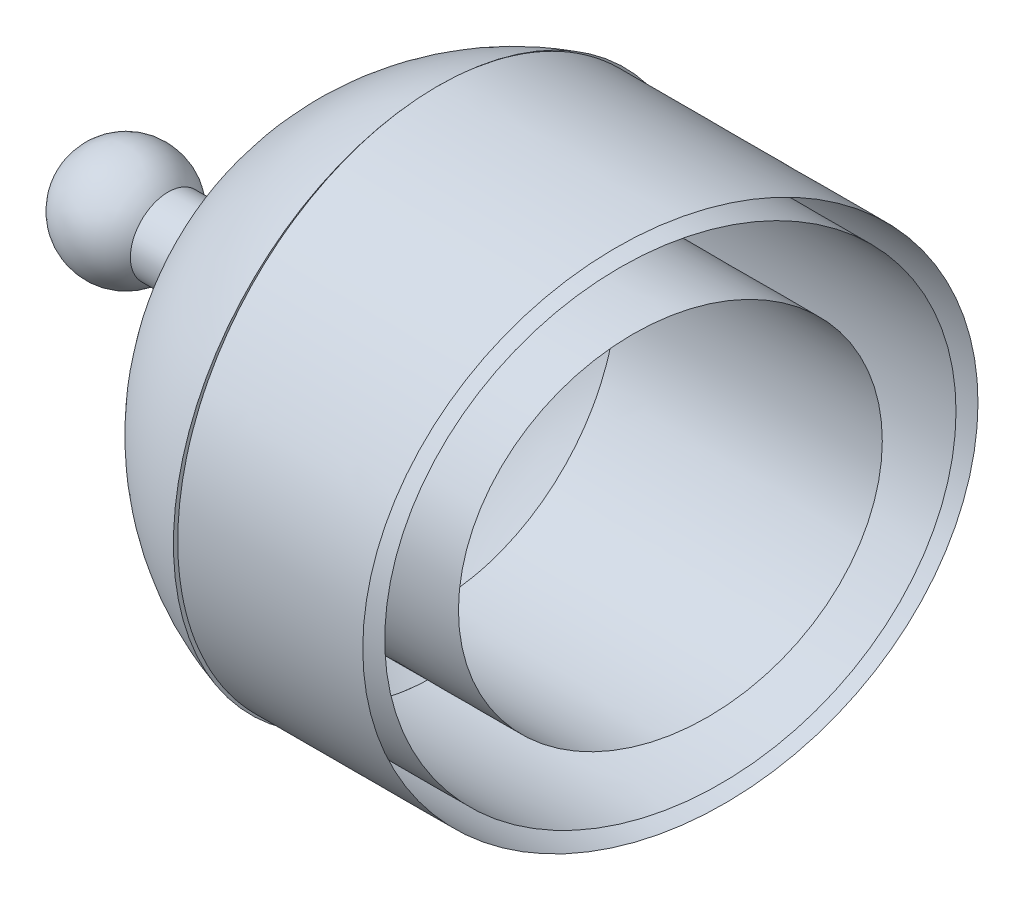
from build123d import *


with BuildPart() as part:
    # Esquisse1 → R_volution2 (revolve)
    with BuildSketch(Plane.XY):
        with BuildLine():
            Line((0.284931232, 0.5), (1.284931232, 0.5))
            Line((1.284931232, 0.5), (1.284931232, 0))
            Line((1.284931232, 0), (-1.024085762, 0))
            ThreePointArc((-1.024085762, 0), (-0.541702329, 0.700629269), (0.284931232, 0.5))
        make_face()
    revolve(axis=Axis((-0.581094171, 0, 0), (1, 0, 0)))

    # Esquisse2 → R_volution3 (revolve)
    with BuildSketch(Plane.XY):
        with BuildLine():
            Line((3.854868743, 3.5), (3.854868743, 3.25))
            ThreePointArc((3.854868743, 3.25), (2.163110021, 2.001360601), (1.518359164, 0))
            Line((1.518359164, 0), (1.218552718, 0))
            ThreePointArc((1.218552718, 0), (1.951368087, 2.190899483), (3.854868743, 3.5))
        make_face()
    revolve(axis=Axis((-1.698782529, 0, 0), (1, 0, 0)))


solid = part.part
